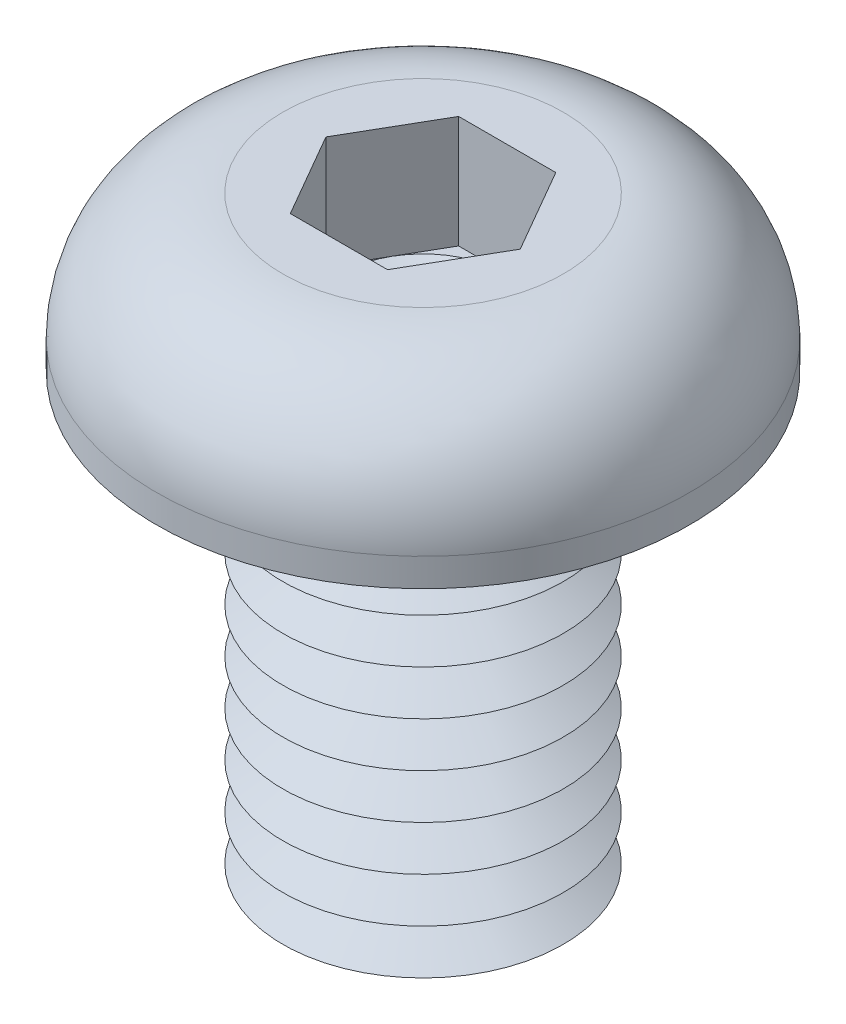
ISO-10303-21;
HEADER;
FILE_DESCRIPTION(('STEP AP214'),'2;1');
FILE_NAME('part.step','',(''),(''),'','','');
FILE_SCHEMA(('AUTOMOTIVE_DESIGN { 1 0 10303 214 1 1 1 1 }'));
ENDSEC;
DATA;
#1=APPLICATION_CONTEXT('core data for automotive mechanical design processes');
#2=APPLICATION_PROTOCOL_DEFINITION('international standard','automotive_design',2000,#1);
#3=PRODUCT_CONTEXT('',#1,'mechanical');
#4=PRODUCT('Part','Part','',(#3));
#5=PRODUCT_RELATED_PRODUCT_CATEGORY('part','',(#4));
#6=PRODUCT_DEFINITION_FORMATION('','',#4);
#7=PRODUCT_DEFINITION_CONTEXT('part definition',#1,'design');
#8=PRODUCT_DEFINITION('design','',#6,#7);
#9=PRODUCT_DEFINITION_SHAPE('','',#8);
#10=(LENGTH_UNIT() NAMED_UNIT(*) SI_UNIT(.MILLI.,.METRE.));
#11=(NAMED_UNIT(*) PLANE_ANGLE_UNIT() SI_UNIT($,.RADIAN.));
#12=(NAMED_UNIT(*) SI_UNIT($,.STERADIAN.) SOLID_ANGLE_UNIT());
#13=UNCERTAINTY_MEASURE_WITH_UNIT(LENGTH_MEASURE(1.E-05),#10,'distance_accuracy_value','');
#14=(GEOMETRIC_REPRESENTATION_CONTEXT(3) GLOBAL_UNCERTAINTY_ASSIGNED_CONTEXT((#13)) GLOBAL_UNIT_ASSIGNED_CONTEXT((#10,
#11,#12)) REPRESENTATION_CONTEXT('',''));
#15=CARTESIAN_POINT('',(0.,0.,0.));
#16=DIRECTION('',(0.,0.,1.));
#17=DIRECTION('',(1.,0.,0.));
#18=AXIS2_PLACEMENT_3D('',#15,#16,#17);
#19=CARTESIAN_POINT('',(0.,0.,0.));
#20=DIRECTION('',(0.,-1.,0.));
#21=DIRECTION('',(0.,0.,-1.));
#22=AXIS2_PLACEMENT_3D('',#19,#20,#21);
#23=TOROIDAL_SURFACE('',#22,2.9,0.4);
#24=CARTESIAN_POINT('',(0.,0.,-3.3));
#25=VERTEX_POINT('',#24);
#26=VERTEX_LOOP('',#25);
#27=FACE_BOUND('',#26,.T.);
#28=ADVANCED_FACE('P0_F12',(#27),#23,.T.);
#29=CLOSED_SHELL('',(#28));
#30=MANIFOLD_SOLID_BREP('P0_B1',#29);
#31=CARTESIAN_POINT('',(0.866025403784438,0.75,-1.5));
#32=DIRECTION('',(0.,1.,0.));
#33=DIRECTION('',(0.,0.,1.));
#34=AXIS2_PLACEMENT_3D('',#31,#32,#33);
#35=PLANE('',#34);
#36=CARTESIAN_POINT('',(0.,0.75,0.));
#37=DIRECTION('',(0.,1.,0.));
#38=DIRECTION('',(0.,0.,1.));
#39=AXIS2_PLACEMENT_3D('',#36,#37,#38);
#40=CIRCLE('',#39,1.5);
#41=CARTESIAN_POINT('',(0.,0.75,1.5));
#42=VERTEX_POINT('',#41);
#43=CARTESIAN_POINT('',(1.29903810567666,0.75,0.75));
#44=VERTEX_POINT('',#43);
#45=EDGE_CURVE('P1_E93',#42,#44,#40,.T.);
#46=ORIENTED_EDGE('',*,*,#45,.F.);
#47=DIRECTION('',(1.,0.,0.));
#48=VECTOR('',#47,1.);
#49=CARTESIAN_POINT('',(-0.866025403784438,0.75,1.5));
#50=LINE('',#49,#48);
#51=CARTESIAN_POINT('',(0.866025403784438,0.75,1.5));
#52=VERTEX_POINT('',#51);
#53=EDGE_CURVE('P1_E116',#42,#52,#50,.T.);
#54=ORIENTED_EDGE('',*,*,#53,.T.);
#55=DIRECTION('',(0.5,0.,-0.866025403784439));
#56=VECTOR('',#55,1.);
#57=CARTESIAN_POINT('',(0.866025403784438,0.75,1.5));
#58=LINE('',#57,#56);
#59=EDGE_CURVE('P1_E112',#52,#44,#58,.T.);
#60=ORIENTED_EDGE('',*,*,#59,.T.);
#61=EDGE_LOOP('',(#46,#54,#60));
#62=FACE_BOUND('',#61,.T.);
#63=ADVANCED_FACE('P1_F15',(#62),#35,.T.);
#64=CARTESIAN_POINT('',(0.,0.75,0.));
#65=DIRECTION('',(0.,1.,0.));
#66=DIRECTION('',(0.,0.,1.));
#67=AXIS2_PLACEMENT_3D('',#64,#65,#66);
#68=CIRCLE('',#67,1.5);
#69=CARTESIAN_POINT('',(1.29903810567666,0.75,-0.750000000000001));
#70=VERTEX_POINT('',#69);
#71=EDGE_CURVE('P1_E10',#44,#70,#68,.T.);
#72=ORIENTED_EDGE('',*,*,#71,.F.);
#73=CARTESIAN_POINT('',(1.73205080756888,0.75,0.));
#74=VERTEX_POINT('',#73);
#75=EDGE_CURVE('P1_E104',#44,#74,#58,.T.);
#76=ORIENTED_EDGE('',*,*,#75,.T.);
#77=DIRECTION('',(-0.5,0.,-0.866025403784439));
#78=VECTOR('',#77,1.);
#79=CARTESIAN_POINT('',(1.73205080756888,0.75,0.));
#80=LINE('',#79,#78);
#81=EDGE_CURVE('P1_E107',#74,#70,#80,.T.);
#82=ORIENTED_EDGE('',*,*,#81,.T.);
#83=EDGE_LOOP('',(#72,#76,#82));
#84=FACE_BOUND('',#83,.T.);
#85=ADVANCED_FACE('P1_F103',(#84),#35,.T.);
#86=CARTESIAN_POINT('',(0.,0.75,-1.5));
#87=VERTEX_POINT('',#86);
#88=EDGE_CURVE('P1_E24',#70,#87,#68,.T.);
#89=ORIENTED_EDGE('',*,*,#88,.F.);
#90=CARTESIAN_POINT('',(0.866025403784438,0.75,-1.5));
#91=VERTEX_POINT('',#90);
#92=EDGE_CURVE('P1_E139',#70,#91,#80,.T.);
#93=ORIENTED_EDGE('',*,*,#92,.T.);
#94=DIRECTION('',(-1.,0.,0.));
#95=VECTOR('',#94,1.);
#96=CARTESIAN_POINT('',(0.866025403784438,0.75,-1.5));
#97=LINE('',#96,#95);
#98=EDGE_CURVE('P1_E276',#91,#87,#97,.T.);
#99=ORIENTED_EDGE('',*,*,#98,.T.);
#100=EDGE_LOOP('',(#89,#93,#99));
#101=FACE_BOUND('',#100,.T.);
#102=ADVANCED_FACE('P1_F241',(#101),#35,.T.);
#103=CARTESIAN_POINT('',(-1.29903810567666,0.75,-0.75));
#104=VERTEX_POINT('',#103);
#105=EDGE_CURVE('P1_E271',#87,#104,#68,.T.);
#106=ORIENTED_EDGE('',*,*,#105,.F.);
#107=CARTESIAN_POINT('',(-0.866025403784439,0.75,-1.5));
#108=VERTEX_POINT('',#107);
#109=EDGE_CURVE('P1_E280',#87,#108,#97,.T.);
#110=ORIENTED_EDGE('',*,*,#109,.T.);
#111=DIRECTION('',(-0.5,0.,0.866025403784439));
#112=VECTOR('',#111,1.);
#113=CARTESIAN_POINT('',(-0.866025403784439,0.75,-1.5));
#114=LINE('',#113,#112);
#115=EDGE_CURVE('P1_E275',#108,#104,#114,.T.);
#116=ORIENTED_EDGE('',*,*,#115,.T.);
#117=EDGE_LOOP('',(#106,#110,#116));
#118=FACE_BOUND('',#117,.T.);
#119=ADVANCED_FACE('P1_F255',(#118),#35,.T.);
#120=CARTESIAN_POINT('',(-1.29903810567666,0.75,0.75));
#121=VERTEX_POINT('',#120);
#122=EDGE_CURVE('P1_E31',#104,#121,#68,.T.);
#123=ORIENTED_EDGE('',*,*,#122,.F.);
#124=CARTESIAN_POINT('',(-1.73205080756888,0.75,0.));
#125=VERTEX_POINT('',#124);
#126=EDGE_CURVE('P1_E267',#104,#125,#114,.T.);
#127=ORIENTED_EDGE('',*,*,#126,.T.);
#128=DIRECTION('',(0.5,0.,0.866025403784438));
#129=VECTOR('',#128,1.);
#130=CARTESIAN_POINT('',(-1.73205080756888,0.75,0.));
#131=LINE('',#130,#129);
#132=EDGE_CURVE('P1_E270',#125,#121,#131,.T.);
#133=ORIENTED_EDGE('',*,*,#132,.T.);
#134=EDGE_LOOP('',(#123,#127,#133));
#135=FACE_BOUND('',#134,.T.);
#136=ADVANCED_FACE('P1_F246',(#135),#35,.T.);
#137=CARTESIAN_POINT('',(0.,-7.2,0.));
#138=DIRECTION('',(0.,1.,0.));
#139=DIRECTION('',(0.,0.,1.));
#140=AXIS2_PLACEMENT_3D('',#137,#138,#139);
#141=CONICAL_SURFACE('',#140,1.80717967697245,1.0471975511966);
#142=CARTESIAN_POINT('',(0.,-6.8,0.));
#143=DIRECTION('',(0.,-1.,0.));
#144=DIRECTION('',(0.,0.,-1.));
#145=AXIS2_PLACEMENT_3D('',#142,#143,#144);
#146=CIRCLE('',#145,2.5);
#147=CARTESIAN_POINT('',(0.,-6.8,-2.5));
#148=VERTEX_POINT('',#147);
#149=EDGE_CURVE('P1_E203',#148,#148,#146,.T.);
#150=ORIENTED_EDGE('',*,*,#149,.T.);
#151=EDGE_LOOP('',(#150));
#152=FACE_BOUND('',#151,.T.);
#153=CARTESIAN_POINT('',(0.,-7.2,0.));
#154=DIRECTION('',(0.,-1.,0.));
#155=DIRECTION('',(0.,0.,-1.));
#156=AXIS2_PLACEMENT_3D('',#153,#154,#155);
#157=CIRCLE('',#156,1.80717967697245);
#158=CARTESIAN_POINT('',(0.,-7.2,-1.80717967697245));
#159=VERTEX_POINT('',#158);
#160=EDGE_CURVE('P1_E206',#159,#159,#157,.T.);
#161=ORIENTED_EDGE('',*,*,#160,.F.);
#162=EDGE_LOOP('',(#161));
#163=FACE_BOUND('',#162,.T.);
#164=ADVANCED_FACE('P1_F254',(#152,#163),#141,.T.);
#165=CARTESIAN_POINT('',(0.,-7.6,0.));
#166=DIRECTION('',(0.,-1.,0.));
#167=DIRECTION('',(0.,0.,-1.));
#168=AXIS2_PLACEMENT_3D('',#165,#166,#167);
#169=CONICAL_SURFACE('',#168,2.5,1.0471975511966);
#170=ORIENTED_EDGE('',*,*,#160,.T.);
#171=EDGE_LOOP('',(#170));
#172=FACE_BOUND('',#171,.T.);
#173=CARTESIAN_POINT('',(0.,-7.6,0.));
#174=DIRECTION('',(0.,-1.,0.));
#175=DIRECTION('',(0.,0.,-1.));
#176=AXIS2_PLACEMENT_3D('',#173,#174,#175);
#177=CIRCLE('',#176,2.5);
#178=CARTESIAN_POINT('',(0.,-7.6,-2.5));
#179=VERTEX_POINT('',#178);
#180=EDGE_CURVE('P1_E209',#179,#179,#177,.T.);
#181=ORIENTED_EDGE('',*,*,#180,.F.);
#182=EDGE_LOOP('',(#181));
#183=FACE_BOUND('',#182,.T.);
#184=ADVANCED_FACE('P1_F261',(#172,#183),#169,.T.);
#185=CARTESIAN_POINT('',(0.,-8.,0.));
#186=DIRECTION('',(0.,1.,0.));
#187=DIRECTION('',(0.,0.,1.));
#188=AXIS2_PLACEMENT_3D('',#185,#186,#187);
#189=PLANE('',#188);
#190=CARTESIAN_POINT('',(0.,-8.,0.));
#191=DIRECTION('',(0.,-1.,0.));
#192=DIRECTION('',(0.,0.,-1.));
#193=AXIS2_PLACEMENT_3D('',#190,#191,#192);
#194=CIRCLE('',#193,1.80717967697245);
#195=CARTESIAN_POINT('',(0.,-8.,-1.80717967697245));
#196=VERTEX_POINT('',#195);
#197=EDGE_CURVE('P1_E212',#196,#196,#194,.T.);
#198=ORIENTED_EDGE('',*,*,#197,.T.);
#199=EDGE_LOOP('',(#198));
#200=FACE_BOUND('',#199,.T.);
#201=ADVANCED_FACE('P1_F339',(#200),#189,.F.);
#202=CARTESIAN_POINT('',(0.,-8.,0.));
#203=DIRECTION('',(0.,1.,0.));
#204=DIRECTION('',(0.,0.,1.));
#205=AXIS2_PLACEMENT_3D('',#202,#203,#204);
#206=CONICAL_SURFACE('',#205,1.80717967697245,1.0471975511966);
#207=ORIENTED_EDGE('',*,*,#180,.T.);
#208=EDGE_LOOP('',(#207));
#209=FACE_BOUND('',#208,.T.);
#210=ORIENTED_EDGE('',*,*,#197,.F.);
#211=EDGE_LOOP('',(#210));
#212=FACE_BOUND('',#211,.T.);
#213=ADVANCED_FACE('P1_F350',(#209,#212),#206,.T.);
#214=CARTESIAN_POINT('',(0.,-6.4,0.));
#215=DIRECTION('',(0.,1.,0.));
#216=DIRECTION('',(0.,0.,1.));
#217=AXIS2_PLACEMENT_3D('',#214,#215,#216);
#218=CONICAL_SURFACE('',#217,1.80717967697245,1.0471975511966);
#219=CARTESIAN_POINT('',(0.,-6.,0.));
#220=DIRECTION('',(0.,-1.,0.));
#221=DIRECTION('',(0.,0.,-1.));
#222=AXIS2_PLACEMENT_3D('',#219,#220,#221);
#223=CIRCLE('',#222,2.5);
#224=CARTESIAN_POINT('',(0.,-6.,-2.5));
#225=VERTEX_POINT('',#224);
#226=EDGE_CURVE('P1_E197',#225,#225,#223,.T.);
#227=ORIENTED_EDGE('',*,*,#226,.T.);
#228=EDGE_LOOP('',(#227));
#229=FACE_BOUND('',#228,.T.);
#230=CARTESIAN_POINT('',(0.,-6.4,0.));
#231=DIRECTION('',(0.,-1.,0.));
#232=DIRECTION('',(0.,0.,-1.));
#233=AXIS2_PLACEMENT_3D('',#230,#231,#232);
#234=CIRCLE('',#233,1.80717967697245);
#235=CARTESIAN_POINT('',(0.,-6.4,-1.80717967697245));
#236=VERTEX_POINT('',#235);
#237=EDGE_CURVE('P1_E200',#236,#236,#234,.T.);
#238=ORIENTED_EDGE('',*,*,#237,.F.);
#239=EDGE_LOOP('',(#238));
#240=FACE_BOUND('',#239,.T.);
#241=ADVANCED_FACE('P1_F359',(#229,#240),#218,.T.);
#242=CARTESIAN_POINT('',(0.,-6.8,0.));
#243=DIRECTION('',(0.,-1.,0.));
#244=DIRECTION('',(0.,0.,-1.));
#245=AXIS2_PLACEMENT_3D('',#242,#243,#244);
#246=CONICAL_SURFACE('',#245,2.5,1.0471975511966);
#247=ORIENTED_EDGE('',*,*,#237,.T.);
#248=EDGE_LOOP('',(#247));
#249=FACE_BOUND('',#248,.T.);
#250=ORIENTED_EDGE('',*,*,#149,.F.);
#251=EDGE_LOOP('',(#250));
#252=FACE_BOUND('',#251,.T.);
#253=ADVANCED_FACE('P1_F368',(#249,#252),#246,.T.);
#254=CARTESIAN_POINT('',(0.,-5.6,0.));
#255=DIRECTION('',(0.,1.,0.));
#256=DIRECTION('',(0.,0.,1.));
#257=AXIS2_PLACEMENT_3D('',#254,#255,#256);
#258=CONICAL_SURFACE('',#257,1.80717967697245,1.0471975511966);
#259=CARTESIAN_POINT('',(0.,-5.2,0.));
#260=DIRECTION('',(0.,-1.,0.));
#261=DIRECTION('',(0.,0.,-1.));
#262=AXIS2_PLACEMENT_3D('',#259,#260,#261);
#263=CIRCLE('',#262,2.5);
#264=CARTESIAN_POINT('',(0.,-5.2,-2.5));
#265=VERTEX_POINT('',#264);
#266=EDGE_CURVE('P1_E191',#265,#265,#263,.T.);
#267=ORIENTED_EDGE('',*,*,#266,.T.);
#268=EDGE_LOOP('',(#267));
#269=FACE_BOUND('',#268,.T.);
#270=CARTESIAN_POINT('',(0.,-5.6,0.));
#271=DIRECTION('',(0.,-1.,0.));
#272=DIRECTION('',(0.,0.,-1.));
#273=AXIS2_PLACEMENT_3D('',#270,#271,#272);
#274=CIRCLE('',#273,1.80717967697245);
#275=CARTESIAN_POINT('',(0.,-5.6,-1.80717967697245));
#276=VERTEX_POINT('',#275);
#277=EDGE_CURVE('P1_E194',#276,#276,#274,.T.);
#278=ORIENTED_EDGE('',*,*,#277,.F.);
#279=EDGE_LOOP('',(#278));
#280=FACE_BOUND('',#279,.T.);
#281=ADVANCED_FACE('P1_F378',(#269,#280),#258,.T.);
#282=CARTESIAN_POINT('',(0.,-6.,0.));
#283=DIRECTION('',(0.,-1.,0.));
#284=DIRECTION('',(0.,0.,-1.));
#285=AXIS2_PLACEMENT_3D('',#282,#283,#284);
#286=CONICAL_SURFACE('',#285,2.5,1.0471975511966);
#287=ORIENTED_EDGE('',*,*,#277,.T.);
#288=EDGE_LOOP('',(#287));
#289=FACE_BOUND('',#288,.T.);
#290=ORIENTED_EDGE('',*,*,#226,.F.);
#291=EDGE_LOOP('',(#290));
#292=FACE_BOUND('',#291,.T.);
#293=ADVANCED_FACE('P1_F388',(#289,#292),#286,.T.);
#294=CARTESIAN_POINT('',(0.,-4.8,0.));
#295=DIRECTION('',(0.,1.,0.));
#296=DIRECTION('',(0.,0.,1.));
#297=AXIS2_PLACEMENT_3D('',#294,#295,#296);
#298=CONICAL_SURFACE('',#297,1.80717967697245,1.0471975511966);
#299=CARTESIAN_POINT('',(0.,-4.4,0.));
#300=DIRECTION('',(0.,-1.,0.));
#301=DIRECTION('',(0.,0.,-1.));
#302=AXIS2_PLACEMENT_3D('',#299,#300,#301);
#303=CIRCLE('',#302,2.5);
#304=CARTESIAN_POINT('',(0.,-4.4,-2.5));
#305=VERTEX_POINT('',#304);
#306=EDGE_CURVE('P1_E185',#305,#305,#303,.T.);
#307=ORIENTED_EDGE('',*,*,#306,.T.);
#308=EDGE_LOOP('',(#307));
#309=FACE_BOUND('',#308,.T.);
#310=CARTESIAN_POINT('',(0.,-4.8,0.));
#311=DIRECTION('',(0.,-1.,0.));
#312=DIRECTION('',(0.,0.,-1.));
#313=AXIS2_PLACEMENT_3D('',#310,#311,#312);
#314=CIRCLE('',#313,1.80717967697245);
#315=CARTESIAN_POINT('',(0.,-4.8,-1.80717967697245));
#316=VERTEX_POINT('',#315);
#317=EDGE_CURVE('P1_E188',#316,#316,#314,.T.);
#318=ORIENTED_EDGE('',*,*,#317,.F.);
#319=EDGE_LOOP('',(#318));
#320=FACE_BOUND('',#319,.T.);
#321=ADVANCED_FACE('P1_F398',(#309,#320),#298,.T.);
#322=CARTESIAN_POINT('',(0.,-5.2,0.));
#323=DIRECTION('',(0.,-1.,0.));
#324=DIRECTION('',(0.,0.,-1.));
#325=AXIS2_PLACEMENT_3D('',#322,#323,#324);
#326=CONICAL_SURFACE('',#325,2.5,1.0471975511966);
#327=ORIENTED_EDGE('',*,*,#317,.T.);
#328=EDGE_LOOP('',(#327));
#329=FACE_BOUND('',#328,.T.);
#330=ORIENTED_EDGE('',*,*,#266,.F.);
#331=EDGE_LOOP('',(#330));
#332=FACE_BOUND('',#331,.T.);
#333=ADVANCED_FACE('P1_F408',(#329,#332),#326,.T.);
#334=CARTESIAN_POINT('',(0.,-4.,0.));
#335=DIRECTION('',(0.,1.,0.));
#336=DIRECTION('',(0.,0.,1.));
#337=AXIS2_PLACEMENT_3D('',#334,#335,#336);
#338=CONICAL_SURFACE('',#337,1.80717967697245,1.0471975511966);
#339=CARTESIAN_POINT('',(0.,-3.6,0.));
#340=DIRECTION('',(0.,-1.,0.));
#341=DIRECTION('',(0.,0.,-1.));
#342=AXIS2_PLACEMENT_3D('',#339,#340,#341);
#343=CIRCLE('',#342,2.5);
#344=CARTESIAN_POINT('',(0.,-3.6,-2.5));
#345=VERTEX_POINT('',#344);
#346=EDGE_CURVE('P1_E179',#345,#345,#343,.T.);
#347=ORIENTED_EDGE('',*,*,#346,.T.);
#348=EDGE_LOOP('',(#347));
#349=FACE_BOUND('',#348,.T.);
#350=CARTESIAN_POINT('',(0.,-4.,0.));
#351=DIRECTION('',(0.,-1.,0.));
#352=DIRECTION('',(0.,0.,-1.));
#353=AXIS2_PLACEMENT_3D('',#350,#351,#352);
#354=CIRCLE('',#353,1.80717967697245);
#355=CARTESIAN_POINT('',(0.,-4.,-1.80717967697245));
#356=VERTEX_POINT('',#355);
#357=EDGE_CURVE('P1_E182',#356,#356,#354,.T.);
#358=ORIENTED_EDGE('',*,*,#357,.F.);
#359=EDGE_LOOP('',(#358));
#360=FACE_BOUND('',#359,.T.);
#361=ADVANCED_FACE('P1_F418',(#349,#360),#338,.T.);
#362=CARTESIAN_POINT('',(0.,-4.4,0.));
#363=DIRECTION('',(0.,-1.,0.));
#364=DIRECTION('',(0.,0.,-1.));
#365=AXIS2_PLACEMENT_3D('',#362,#363,#364);
#366=CONICAL_SURFACE('',#365,2.5,1.0471975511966);
#367=ORIENTED_EDGE('',*,*,#357,.T.);
#368=EDGE_LOOP('',(#367));
#369=FACE_BOUND('',#368,.T.);
#370=ORIENTED_EDGE('',*,*,#306,.F.);
#371=EDGE_LOOP('',(#370));
#372=FACE_BOUND('',#371,.T.);
#373=ADVANCED_FACE('P1_F428',(#369,#372),#366,.T.);
#374=CARTESIAN_POINT('',(0.,-3.2,0.));
#375=DIRECTION('',(0.,1.,0.));
#376=DIRECTION('',(0.,0.,1.));
#377=AXIS2_PLACEMENT_3D('',#374,#375,#376);
#378=CONICAL_SURFACE('',#377,1.80717967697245,1.0471975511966);
#379=CARTESIAN_POINT('',(0.,-2.8,0.));
#380=DIRECTION('',(0.,-1.,0.));
#381=DIRECTION('',(0.,0.,-1.));
#382=AXIS2_PLACEMENT_3D('',#379,#380,#381);
#383=CIRCLE('',#382,2.5);
#384=CARTESIAN_POINT('',(0.,-2.8,-2.5));
#385=VERTEX_POINT('',#384);
#386=EDGE_CURVE('P1_E173',#385,#385,#383,.T.);
#387=ORIENTED_EDGE('',*,*,#386,.T.);
#388=EDGE_LOOP('',(#387));
#389=FACE_BOUND('',#388,.T.);
#390=CARTESIAN_POINT('',(0.,-3.2,0.));
#391=DIRECTION('',(0.,-1.,0.));
#392=DIRECTION('',(0.,0.,-1.));
#393=AXIS2_PLACEMENT_3D('',#390,#391,#392);
#394=CIRCLE('',#393,1.80717967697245);
#395=CARTESIAN_POINT('',(0.,-3.2,-1.80717967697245));
#396=VERTEX_POINT('',#395);
#397=EDGE_CURVE('P1_E176',#396,#396,#394,.T.);
#398=ORIENTED_EDGE('',*,*,#397,.F.);
#399=EDGE_LOOP('',(#398));
#400=FACE_BOUND('',#399,.T.);
#401=ADVANCED_FACE('P1_F438',(#389,#400),#378,.T.);
#402=CARTESIAN_POINT('',(0.,-3.6,0.));
#403=DIRECTION('',(0.,-1.,0.));
#404=DIRECTION('',(0.,0.,-1.));
#405=AXIS2_PLACEMENT_3D('',#402,#403,#404);
#406=CONICAL_SURFACE('',#405,2.5,1.0471975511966);
#407=ORIENTED_EDGE('',*,*,#397,.T.);
#408=EDGE_LOOP('',(#407));
#409=FACE_BOUND('',#408,.T.);
#410=ORIENTED_EDGE('',*,*,#346,.F.);
#411=EDGE_LOOP('',(#410));
#412=FACE_BOUND('',#411,.T.);
#413=ADVANCED_FACE('P1_F448',(#409,#412),#406,.T.);
#414=CARTESIAN_POINT('',(0.,-2.4,0.));
#415=DIRECTION('',(0.,1.,0.));
#416=DIRECTION('',(0.,0.,1.));
#417=AXIS2_PLACEMENT_3D('',#414,#415,#416);
#418=CONICAL_SURFACE('',#417,1.80717967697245,1.0471975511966);
#419=CARTESIAN_POINT('',(0.,-2.,0.));
#420=DIRECTION('',(0.,-1.,0.));
#421=DIRECTION('',(0.,0.,-1.));
#422=AXIS2_PLACEMENT_3D('',#419,#420,#421);
#423=CIRCLE('',#422,2.5);
#424=CARTESIAN_POINT('',(0.,-2.,-2.5));
#425=VERTEX_POINT('',#424);
#426=EDGE_CURVE('P1_E164',#425,#425,#423,.T.);
#427=ORIENTED_EDGE('',*,*,#426,.T.);
#428=EDGE_LOOP('',(#427));
#429=FACE_BOUND('',#428,.T.);
#430=CARTESIAN_POINT('',(0.,-2.4,0.));
#431=DIRECTION('',(0.,-1.,0.));
#432=DIRECTION('',(0.,0.,-1.));
#433=AXIS2_PLACEMENT_3D('',#430,#431,#432);
#434=CIRCLE('',#433,1.80717967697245);
#435=CARTESIAN_POINT('',(0.,-2.4,-1.80717967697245));
#436=VERTEX_POINT('',#435);
#437=EDGE_CURVE('P1_E170',#436,#436,#434,.T.);
#438=ORIENTED_EDGE('',*,*,#437,.F.);
#439=EDGE_LOOP('',(#438));
#440=FACE_BOUND('',#439,.T.);
#441=ADVANCED_FACE('P1_F458',(#429,#440),#418,.T.);
#442=CARTESIAN_POINT('',(0.,-2.8,0.));
#443=DIRECTION('',(0.,-1.,0.));
#444=DIRECTION('',(0.,0.,-1.));
#445=AXIS2_PLACEMENT_3D('',#442,#443,#444);
#446=CONICAL_SURFACE('',#445,2.5,1.0471975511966);
#447=ORIENTED_EDGE('',*,*,#437,.T.);
#448=EDGE_LOOP('',(#447));
#449=FACE_BOUND('',#448,.T.);
#450=ORIENTED_EDGE('',*,*,#386,.F.);
#451=EDGE_LOOP('',(#450));
#452=FACE_BOUND('',#451,.T.);
#453=ADVANCED_FACE('P1_F468',(#449,#452),#446,.T.);
#454=CARTESIAN_POINT('',(0.,-1.6,0.));
#455=DIRECTION('',(0.,1.,0.));
#456=DIRECTION('',(0.,0.,1.));
#457=AXIS2_PLACEMENT_3D('',#454,#455,#456);
#458=CONICAL_SURFACE('',#457,1.80717967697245,1.0471975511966);
#459=CARTESIAN_POINT('',(0.,-1.2,0.));
#460=DIRECTION('',(0.,-1.,0.));
#461=DIRECTION('',(0.,0.,-1.));
#462=AXIS2_PLACEMENT_3D('',#459,#460,#461);
#463=CIRCLE('',#462,2.5);
#464=CARTESIAN_POINT('',(0.,-1.2,-2.5));
#465=VERTEX_POINT('',#464);
#466=EDGE_CURVE('P1_E167',#465,#465,#463,.T.);
#467=ORIENTED_EDGE('',*,*,#466,.T.);
#468=EDGE_LOOP('',(#467));
#469=FACE_BOUND('',#468,.T.);
#470=CARTESIAN_POINT('',(0.,-1.6,0.));
#471=DIRECTION('',(0.,-1.,0.));
#472=DIRECTION('',(0.,0.,-1.));
#473=AXIS2_PLACEMENT_3D('',#470,#471,#472);
#474=CIRCLE('',#473,1.80717967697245);
#475=CARTESIAN_POINT('',(0.,-1.6,-1.80717967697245));
#476=VERTEX_POINT('',#475);
#477=EDGE_CURVE('P1_E161',#476,#476,#474,.T.);
#478=ORIENTED_EDGE('',*,*,#477,.F.);
#479=EDGE_LOOP('',(#478));
#480=FACE_BOUND('',#479,.T.);
#481=ADVANCED_FACE('P1_F478',(#469,#480),#458,.T.);
#482=CARTESIAN_POINT('',(0.,-2.,0.));
#483=DIRECTION('',(0.,-1.,0.));
#484=DIRECTION('',(0.,0.,-1.));
#485=AXIS2_PLACEMENT_3D('',#482,#483,#484);
#486=CONICAL_SURFACE('',#485,2.5,1.0471975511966);
#487=ORIENTED_EDGE('',*,*,#477,.T.);
#488=EDGE_LOOP('',(#487));
#489=FACE_BOUND('',#488,.T.);
#490=ORIENTED_EDGE('',*,*,#426,.F.);
#491=EDGE_LOOP('',(#490));
#492=FACE_BOUND('',#491,.T.);
#493=ADVANCED_FACE('P1_F488',(#489,#492),#486,.T.);
#494=CARTESIAN_POINT('',(0.,-8.,0.));
#495=DIRECTION('',(0.,1.,0.));
#496=DIRECTION('',(0.,0.,1.));
#497=AXIS2_PLACEMENT_3D('',#494,#495,#496);
#498=CYLINDRICAL_SURFACE('',#497,2.5);
#499=CARTESIAN_POINT('',(0.,0.,0.));
#500=DIRECTION('',(0.,-1.,0.));
#501=DIRECTION('',(1.,0.,0.));
#502=AXIS2_PLACEMENT_3D('',#499,#500,#501);
#503=CIRCLE('',#502,2.5);
#504=CARTESIAN_POINT('',(2.5,0.,0.));
#505=VERTEX_POINT('',#504);
#506=EDGE_CURVE('P1_E141',#505,#505,#503,.F.);
#507=ORIENTED_EDGE('',*,*,#506,.F.);
#508=EDGE_LOOP('',(#507));
#509=FACE_BOUND('',#508,.T.);
#510=ORIENTED_EDGE('',*,*,#466,.F.);
#511=EDGE_LOOP('',(#510));
#512=FACE_BOUND('',#511,.T.);
#513=ADVANCED_FACE('P1_F17',(#509,#512),#498,.T.);
#514=CARTESIAN_POINT('',(0.,0.,0.));
#515=DIRECTION('',(0.,-1.,0.));
#516=DIRECTION('',(0.,0.,-1.));
#517=AXIS2_PLACEMENT_3D('',#514,#515,#516);
#518=TOROIDAL_SURFACE('',#517,2.9,0.4);
#519=ORIENTED_EDGE('',*,*,#506,.T.);
#520=EDGE_LOOP('',(#519));
#521=FACE_BOUND('',#520,.T.);
#522=CARTESIAN_POINT('',(0.,0.,0.));
#523=DIRECTION('',(0.,1.,0.));
#524=DIRECTION('',(-1.,0.,0.));
#525=AXIS2_PLACEMENT_3D('',#522,#523,#524);
#526=CIRCLE('',#525,3.3);
#527=CARTESIAN_POINT('',(-3.3,0.,0.));
#528=VERTEX_POINT('',#527);
#529=EDGE_CURVE('P1_E151',#528,#528,#526,.F.);
#530=ORIENTED_EDGE('',*,*,#529,.T.);
#531=EDGE_LOOP('',(#530));
#532=FACE_BOUND('',#531,.T.);
#533=ADVANCED_FACE('P1_F217',(#521,#532),#518,.F.);
#534=CARTESIAN_POINT('',(2.5,2.75,0.));
#535=DIRECTION('',(0.,-1.,0.));
#536=DIRECTION('',(1.,0.,0.));
#537=AXIS2_PLACEMENT_3D('',#534,#535,#536);
#538=PLANE('',#537);
#539=DIRECTION('',(-1.,0.,0.));
#540=VECTOR('',#539,1.);
#541=CARTESIAN_POINT('',(0.866025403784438,2.75,-1.5));
#542=LINE('',#541,#540);
#543=CARTESIAN_POINT('',(0.866025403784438,2.75,-1.5));
#544=VERTEX_POINT('',#543);
#545=CARTESIAN_POINT('',(-0.866025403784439,2.75,-1.5));
#546=VERTEX_POINT('',#545);
#547=EDGE_CURVE('P1_E125',#544,#546,#542,.T.);
#548=ORIENTED_EDGE('',*,*,#547,.F.);
#549=DIRECTION('',(-0.5,0.,-0.866025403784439));
#550=VECTOR('',#549,1.);
#551=CARTESIAN_POINT('',(1.73205080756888,2.75,0.));
#552=LINE('',#551,#550);
#553=CARTESIAN_POINT('',(1.73205080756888,2.75,0.));
#554=VERTEX_POINT('',#553);
#555=EDGE_CURVE('P1_E39',#554,#544,#552,.T.);
#556=ORIENTED_EDGE('',*,*,#555,.F.);
#557=DIRECTION('',(0.5,0.,-0.866025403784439));
#558=VECTOR('',#557,1.);
#559=CARTESIAN_POINT('',(0.866025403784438,2.75,1.5));
#560=LINE('',#559,#558);
#561=CARTESIAN_POINT('',(0.866025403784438,2.75,1.5));
#562=VERTEX_POINT('',#561);
#563=EDGE_CURVE('P1_E137',#562,#554,#560,.T.);
#564=ORIENTED_EDGE('',*,*,#563,.F.);
#565=DIRECTION('',(1.,0.,0.));
#566=VECTOR('',#565,1.);
#567=CARTESIAN_POINT('',(-0.866025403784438,2.75,1.5));
#568=LINE('',#567,#566);
#569=CARTESIAN_POINT('',(-0.866025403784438,2.75,1.5));
#570=VERTEX_POINT('',#569);
#571=EDGE_CURVE('P1_E134',#570,#562,#568,.T.);
#572=ORIENTED_EDGE('',*,*,#571,.F.);
#573=DIRECTION('',(0.5,0.,0.866025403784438));
#574=VECTOR('',#573,1.);
#575=CARTESIAN_POINT('',(-1.73205080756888,2.75,0.));
#576=LINE('',#575,#574);
#577=CARTESIAN_POINT('',(-1.73205080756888,2.75,0.));
#578=VERTEX_POINT('',#577);
#579=EDGE_CURVE('P1_E131',#578,#570,#576,.T.);
#580=ORIENTED_EDGE('',*,*,#579,.F.);
#581=DIRECTION('',(-0.5,0.,0.866025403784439));
#582=VECTOR('',#581,1.);
#583=CARTESIAN_POINT('',(-0.866025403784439,2.75,-1.5));
#584=LINE('',#583,#582);
#585=EDGE_CURVE('P1_E128',#546,#578,#584,.T.);
#586=ORIENTED_EDGE('',*,*,#585,.F.);
#587=EDGE_LOOP('',(#548,#556,#564,#572,#580,#586));
#588=FACE_BOUND('',#587,.T.);
#589=CARTESIAN_POINT('',(0.,2.75,0.));
#590=DIRECTION('',(0.,1.,0.));
#591=DIRECTION('',(-1.,0.,0.));
#592=AXIS2_PLACEMENT_3D('',#589,#590,#591);
#593=CIRCLE('',#592,2.5);
#594=CARTESIAN_POINT('',(-2.5,2.75,0.));
#595=VERTEX_POINT('',#594);
#596=EDGE_CURVE('P1_E152',#595,#595,#593,.T.);
#597=ORIENTED_EDGE('',*,*,#596,.T.);
#598=EDGE_LOOP('',(#597));
#599=FACE_BOUND('',#598,.T.);
#600=ADVANCED_FACE('P1_F295',(#588,#599),#538,.F.);
#601=CARTESIAN_POINT('',(0.,0.5,0.));
#602=DIRECTION('',(0.,1.,0.));
#603=DIRECTION('',(-1.,0.,0.));
#604=AXIS2_PLACEMENT_3D('',#601,#602,#603);
#605=TOROIDAL_SURFACE('',#604,2.5,2.25);
#606=ORIENTED_EDGE('',*,*,#596,.F.);
#607=EDGE_LOOP('',(#606));
#608=FACE_BOUND('',#607,.T.);
#609=CARTESIAN_POINT('',(0.,0.5,0.));
#610=DIRECTION('',(0.,1.,0.));
#611=DIRECTION('',(-1.,0.,0.));
#612=AXIS2_PLACEMENT_3D('',#609,#610,#611);
#613=CIRCLE('',#612,4.75);
#614=CARTESIAN_POINT('',(-4.75,0.5,0.));
#615=VERTEX_POINT('',#614);
#616=EDGE_CURVE('P1_E155',#615,#615,#613,.T.);
#617=ORIENTED_EDGE('',*,*,#616,.T.);
#618=EDGE_LOOP('',(#617));
#619=FACE_BOUND('',#618,.T.);
#620=ADVANCED_FACE('P1_F231',(#608,#619),#605,.T.);
#621=CARTESIAN_POINT('',(0.,2.75,0.));
#622=DIRECTION('',(0.,1.,0.));
#623=DIRECTION('',(-1.,0.,0.));
#624=AXIS2_PLACEMENT_3D('',#621,#622,#623);
#625=CYLINDRICAL_SURFACE('',#624,4.75);
#626=ORIENTED_EDGE('',*,*,#616,.F.);
#627=EDGE_LOOP('',(#626));
#628=FACE_BOUND('',#627,.T.);
#629=CARTESIAN_POINT('',(0.,0.,0.));
#630=DIRECTION('',(0.,1.,0.));
#631=DIRECTION('',(-1.,0.,0.));
#632=AXIS2_PLACEMENT_3D('',#629,#630,#631);
#633=CIRCLE('',#632,4.75);
#634=CARTESIAN_POINT('',(-4.75,0.,0.));
#635=VERTEX_POINT('',#634);
#636=EDGE_CURVE('P1_E158',#635,#635,#633,.T.);
#637=ORIENTED_EDGE('',*,*,#636,.T.);
#638=EDGE_LOOP('',(#637));
#639=FACE_BOUND('',#638,.T.);
#640=ADVANCED_FACE('P1_F222',(#628,#639),#625,.T.);
#641=CARTESIAN_POINT('',(0.,0.,0.));
#642=DIRECTION('',(0.,1.,0.));
#643=DIRECTION('',(-1.,0.,0.));
#644=AXIS2_PLACEMENT_3D('',#641,#642,#643);
#645=PLANE('',#644);
#646=ORIENTED_EDGE('',*,*,#636,.F.);
#647=EDGE_LOOP('',(#646));
#648=FACE_BOUND('',#647,.T.);
#649=ORIENTED_EDGE('',*,*,#529,.F.);
#650=EDGE_LOOP('',(#649));
#651=FACE_BOUND('',#650,.T.);
#652=ADVANCED_FACE('P1_F219',(#648,#651),#645,.F.);
#653=CARTESIAN_POINT('',(1.73205080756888,0.75,0.));
#654=DIRECTION('',(0.866025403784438,0.,-0.5));
#655=DIRECTION('',(-0.5,0.,-0.866025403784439));
#656=AXIS2_PLACEMENT_3D('',#653,#654,#655);
#657=PLANE('',#656);
#658=ORIENTED_EDGE('',*,*,#555,.T.);
#659=DIRECTION('',(0.,1.,0.));
#660=VECTOR('',#659,1.);
#661=CARTESIAN_POINT('',(0.866025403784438,0.75,-1.5));
#662=LINE('',#661,#660);
#663=EDGE_CURVE('P1_E118',#91,#544,#662,.T.);
#664=ORIENTED_EDGE('',*,*,#663,.F.);
#665=ORIENTED_EDGE('',*,*,#92,.F.);
#666=ORIENTED_EDGE('',*,*,#81,.F.);
#667=DIRECTION('',(0.,1.,0.));
#668=VECTOR('',#667,1.);
#669=CARTESIAN_POINT('',(1.73205080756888,0.75,0.));
#670=LINE('',#669,#668);
#671=EDGE_CURVE('P1_E113',#74,#554,#670,.T.);
#672=ORIENTED_EDGE('',*,*,#671,.T.);
#673=EDGE_LOOP('',(#658,#664,#665,#666,#672));
#674=FACE_BOUND('',#673,.T.);
#675=ADVANCED_FACE('P1_F221',(#674),#657,.F.);
#676=CARTESIAN_POINT('',(0.866025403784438,0.75,1.5));
#677=DIRECTION('',(0.866025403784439,0.,0.5));
#678=DIRECTION('',(0.5,0.,-0.866025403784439));
#679=AXIS2_PLACEMENT_3D('',#676,#677,#678);
#680=PLANE('',#679);
#681=ORIENTED_EDGE('',*,*,#563,.T.);
#682=ORIENTED_EDGE('',*,*,#671,.F.);
#683=ORIENTED_EDGE('',*,*,#75,.F.);
#684=ORIENTED_EDGE('',*,*,#59,.F.);
#685=DIRECTION('',(0.,1.,0.));
#686=VECTOR('',#685,1.);
#687=CARTESIAN_POINT('',(0.866025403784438,0.75,1.5));
#688=LINE('',#687,#686);
#689=EDGE_CURVE('P1_E142',#52,#562,#688,.T.);
#690=ORIENTED_EDGE('',*,*,#689,.T.);
#691=EDGE_LOOP('',(#681,#682,#683,#684,#690));
#692=FACE_BOUND('',#691,.T.);
#693=ADVANCED_FACE('P1_F111',(#692),#680,.F.);
#694=CARTESIAN_POINT('',(-0.866025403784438,0.75,1.5));
#695=DIRECTION('',(0.,0.,1.));
#696=DIRECTION('',(1.,0.,0.));
#697=AXIS2_PLACEMENT_3D('',#694,#695,#696);
#698=PLANE('',#697);
#699=ORIENTED_EDGE('',*,*,#571,.T.);
#700=ORIENTED_EDGE('',*,*,#689,.F.);
#701=ORIENTED_EDGE('',*,*,#53,.F.);
#702=CARTESIAN_POINT('',(-0.866025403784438,0.75,1.5));
#703=VERTEX_POINT('',#702);
#704=EDGE_CURVE('P1_E114',#703,#42,#50,.T.);
#705=ORIENTED_EDGE('',*,*,#704,.F.);
#706=DIRECTION('',(0.,1.,0.));
#707=VECTOR('',#706,1.);
#708=CARTESIAN_POINT('',(-0.866025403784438,0.75,1.5));
#709=LINE('',#708,#707);
#710=EDGE_CURVE('P1_E144',#703,#570,#709,.T.);
#711=ORIENTED_EDGE('',*,*,#710,.T.);
#712=EDGE_LOOP('',(#699,#700,#701,#705,#711));
#713=FACE_BOUND('',#712,.T.);
#714=ADVANCED_FACE('P1_F290',(#713),#698,.F.);
#715=CARTESIAN_POINT('',(-1.73205080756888,0.75,0.));
#716=DIRECTION('',(-0.866025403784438,0.,0.5));
#717=DIRECTION('',(0.5,0.,0.866025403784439));
#718=AXIS2_PLACEMENT_3D('',#715,#716,#717);
#719=PLANE('',#718);
#720=ORIENTED_EDGE('',*,*,#579,.T.);
#721=ORIENTED_EDGE('',*,*,#710,.F.);
#722=EDGE_CURVE('P1_E282',#121,#703,#131,.T.);
#723=ORIENTED_EDGE('',*,*,#722,.F.);
#724=ORIENTED_EDGE('',*,*,#132,.F.);
#725=DIRECTION('',(0.,1.,0.));
#726=VECTOR('',#725,1.);
#727=CARTESIAN_POINT('',(-1.73205080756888,0.75,0.));
#728=LINE('',#727,#726);
#729=EDGE_CURVE('P1_E146',#125,#578,#728,.T.);
#730=ORIENTED_EDGE('',*,*,#729,.T.);
#731=EDGE_LOOP('',(#720,#721,#723,#724,#730));
#732=FACE_BOUND('',#731,.T.);
#733=ADVANCED_FACE('P1_F566',(#732),#719,.F.);
#734=CARTESIAN_POINT('',(-0.866025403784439,0.75,-1.5));
#735=DIRECTION('',(-0.866025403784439,0.,-0.5));
#736=DIRECTION('',(-0.5,0.,0.866025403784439));
#737=AXIS2_PLACEMENT_3D('',#734,#735,#736);
#738=PLANE('',#737);
#739=ORIENTED_EDGE('',*,*,#585,.T.);
#740=ORIENTED_EDGE('',*,*,#729,.F.);
#741=ORIENTED_EDGE('',*,*,#126,.F.);
#742=ORIENTED_EDGE('',*,*,#115,.F.);
#743=DIRECTION('',(0.,1.,0.));
#744=VECTOR('',#743,1.);
#745=CARTESIAN_POINT('',(-0.866025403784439,0.75,-1.5));
#746=LINE('',#745,#744);
#747=EDGE_CURVE('P1_E119',#108,#546,#746,.T.);
#748=ORIENTED_EDGE('',*,*,#747,.T.);
#749=EDGE_LOOP('',(#739,#740,#741,#742,#748));
#750=FACE_BOUND('',#749,.T.);
#751=ADVANCED_FACE('P1_F250',(#750),#738,.F.);
#752=CARTESIAN_POINT('',(0.866025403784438,0.75,-1.5));
#753=DIRECTION('',(0.,0.,-1.));
#754=DIRECTION('',(-1.,0.,0.));
#755=AXIS2_PLACEMENT_3D('',#752,#753,#754);
#756=PLANE('',#755);
#757=ORIENTED_EDGE('',*,*,#547,.T.);
#758=ORIENTED_EDGE('',*,*,#747,.F.);
#759=ORIENTED_EDGE('',*,*,#109,.F.);
#760=ORIENTED_EDGE('',*,*,#98,.F.);
#761=ORIENTED_EDGE('',*,*,#663,.T.);
#762=EDGE_LOOP('',(#757,#758,#759,#760,#761));
#763=FACE_BOUND('',#762,.T.);
#764=ADVANCED_FACE('P1_F244',(#763),#756,.F.);
#765=EDGE_CURVE('P1_E19',#121,#42,#68,.T.);
#766=ORIENTED_EDGE('',*,*,#765,.F.);
#767=ORIENTED_EDGE('',*,*,#722,.T.);
#768=ORIENTED_EDGE('',*,*,#704,.T.);
#769=EDGE_LOOP('',(#766,#767,#768));
#770=FACE_BOUND('',#769,.T.);
#771=ADVANCED_FACE('P1_F90',(#770),#35,.T.);
#772=CARTESIAN_POINT('',(0.,0.75,0.));
#773=DIRECTION('',(0.,1.,0.));
#774=DIRECTION('',(0.,0.,1.));
#775=AXIS2_PLACEMENT_3D('',#772,#773,#774);
#776=CONICAL_SURFACE('',#775,1.5,1.0471975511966);
#777=CARTESIAN_POINT('',(0.,-0.116025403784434,0.));
#778=VERTEX_POINT('',#777);
#779=VERTEX_LOOP('',#778);
#780=FACE_BOUND('',#779,.T.);
#781=ORIENTED_EDGE('',*,*,#45,.T.);
#782=ORIENTED_EDGE('',*,*,#71,.T.);
#783=ORIENTED_EDGE('',*,*,#88,.T.);
#784=ORIENTED_EDGE('',*,*,#105,.T.);
#785=ORIENTED_EDGE('',*,*,#122,.T.);
#786=ORIENTED_EDGE('',*,*,#765,.T.);
#787=EDGE_LOOP('',(#781,#782,#783,#784,#785,#786));
#788=FACE_BOUND('',#787,.T.);
#789=ADVANCED_FACE('P1_F88',(#780,#788),#776,.F.);
#790=CLOSED_SHELL('',(#63,#85,#102,#119,#136,#164,#184,#201,#213,#241,#253,#281,#293,#321,#333,
#361,#373,#401,#413,#441,#453,#481,#493,#513,#533,#600,#620,#640,#652,#675,#693,#714,#733,#751,
#764,#771,#789));
#791=MANIFOLD_SOLID_BREP('P1_B1',#790);
#792=ADVANCED_BREP_SHAPE_REPRESENTATION('',(#18,#30,#791),#14);
#793=SHAPE_DEFINITION_REPRESENTATION(#9,#792);
ENDSEC;
END-ISO-10303-21;
